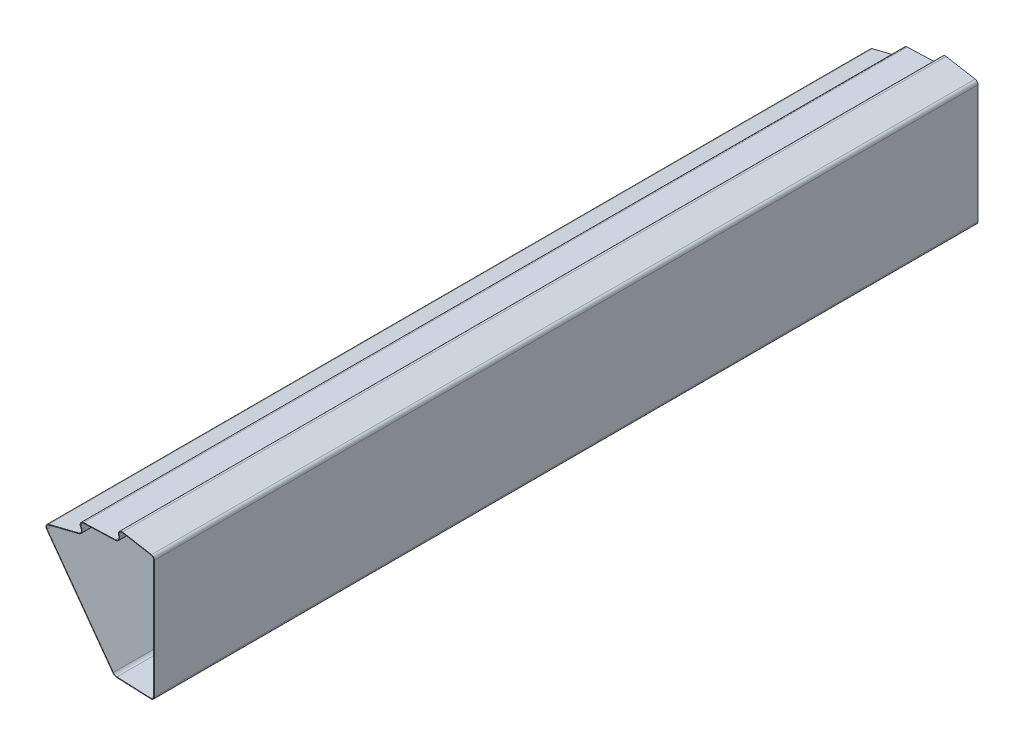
ISO-10303-21;
HEADER;
FILE_DESCRIPTION(('STEP AP214'),'2;1');
FILE_NAME('part.step','',(''),(''),'','','');
FILE_SCHEMA(('AUTOMOTIVE_DESIGN { 1 0 10303 214 1 1 1 1 }'));
ENDSEC;
DATA;
#1=APPLICATION_CONTEXT('core data for automotive mechanical design processes');
#2=APPLICATION_PROTOCOL_DEFINITION('international standard','automotive_design',2000,#1);
#3=PRODUCT_CONTEXT('',#1,'mechanical');
#4=PRODUCT('Part','Part','',(#3));
#5=PRODUCT_RELATED_PRODUCT_CATEGORY('part','',(#4));
#6=PRODUCT_DEFINITION_FORMATION('','',#4);
#7=PRODUCT_DEFINITION_CONTEXT('part definition',#1,'design');
#8=PRODUCT_DEFINITION('design','',#6,#7);
#9=PRODUCT_DEFINITION_SHAPE('','',#8);
#10=(LENGTH_UNIT() NAMED_UNIT(*) SI_UNIT(.MILLI.,.METRE.));
#11=(NAMED_UNIT(*) PLANE_ANGLE_UNIT() SI_UNIT($,.RADIAN.));
#12=(NAMED_UNIT(*) SI_UNIT($,.STERADIAN.) SOLID_ANGLE_UNIT());
#13=UNCERTAINTY_MEASURE_WITH_UNIT(LENGTH_MEASURE(1.E-05),#10,'distance_accuracy_value','');
#14=(GEOMETRIC_REPRESENTATION_CONTEXT(3) GLOBAL_UNCERTAINTY_ASSIGNED_CONTEXT((#13)) GLOBAL_UNIT_ASSIGNED_CONTEXT((#10,
#11,#12)) REPRESENTATION_CONTEXT('',''));
#15=CARTESIAN_POINT('',(0.,0.,0.));
#16=DIRECTION('',(0.,0.,1.));
#17=DIRECTION('',(1.,0.,0.));
#18=AXIS2_PLACEMENT_3D('',#15,#16,#17);
#19=CARTESIAN_POINT('',(-16.8583921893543,28.8514421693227,-213.5));
#20=DIRECTION('',(0.,0.,1.));
#21=DIRECTION('',(1.,0.,0.));
#22=AXIS2_PLACEMENT_3D('',#19,#20,#21);
#23=CYLINDRICAL_SURFACE('',#22,2.31972643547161);
#24=DIRECTION('',(0.,0.,1.));
#25=VECTOR('',#24,1.);
#26=CARTESIAN_POINT('',(-16.9638016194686,26.5341118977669,-213.5));
#27=LINE('',#26,#25);
#28=CARTESIAN_POINT('',(-16.9638016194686,26.5341118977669,-213.5));
#29=VERTEX_POINT('',#28);
#30=CARTESIAN_POINT('',(-16.9638016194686,26.5341118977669,137.50025));
#31=VERTEX_POINT('',#30);
#32=EDGE_CURVE('E228',#29,#31,#27,.T.);
#33=ORIENTED_EDGE('',*,*,#32,.T.);
#34=CARTESIAN_POINT('',(-16.8583921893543,28.8514421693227,137.50025));
#35=DIRECTION('',(0.,0.,1.));
#36=DIRECTION('',(-1.,0.,0.));
#37=AXIS2_PLACEMENT_3D('',#34,#35,#36);
#38=CIRCLE('',#37,2.31972643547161);
#39=CARTESIAN_POINT('',(-18.7350902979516,27.4879411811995,137.50025));
#40=VERTEX_POINT('',#39);
#41=EDGE_CURVE('E501',#40,#31,#38,.T.);
#42=ORIENTED_EDGE('',*,*,#41,.F.);
#43=DIRECTION('',(0.,0.,1.));
#44=VECTOR('',#43,1.);
#45=CARTESIAN_POINT('',(-18.7350902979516,27.4879411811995,-213.5));
#46=LINE('',#45,#44);
#47=CARTESIAN_POINT('',(-18.7350902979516,27.4879411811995,-213.5));
#48=VERTEX_POINT('',#47);
#49=EDGE_CURVE('E12',#48,#40,#46,.T.);
#50=ORIENTED_EDGE('',*,*,#49,.F.);
#51=CARTESIAN_POINT('',(-16.8583921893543,28.8514421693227,-213.5));
#52=DIRECTION('',(0.,0.,1.));
#53=DIRECTION('',(-1.,0.,0.));
#54=AXIS2_PLACEMENT_3D('',#51,#52,#53);
#55=CIRCLE('',#54,2.31972643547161);
#56=EDGE_CURVE('E592',#48,#29,#55,.T.);
#57=ORIENTED_EDGE('',*,*,#56,.T.);
#58=EDGE_LOOP('',(#33,#42,#50,#57));
#59=FACE_BOUND('',#58,.T.);
#60=ADVANCED_FACE('F225',(#59),#23,.T.);
#61=CARTESIAN_POINT('',(-46.8996745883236,66.2531657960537,-213.5));
#62=DIRECTION('',(-0.809016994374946,-0.587785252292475,0.));
#63=DIRECTION('',(0.587785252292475,-0.809016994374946,0.));
#64=AXIS2_PLACEMENT_3D('',#61,#62,#63);
#65=PLANE('',#64);
#66=ORIENTED_EDGE('',*,*,#49,.T.);
#67=DIRECTION('',(0.587785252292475,-0.809016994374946,0.));
#68=VECTOR('',#67,1.);
#69=CARTESIAN_POINT('',(-46.8996745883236,66.2531657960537,137.50025));
#70=LINE('',#69,#68);
#71=CARTESIAN_POINT('',(-46.8996745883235,66.2531657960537,137.50025));
#72=VERTEX_POINT('',#71);
#73=EDGE_CURVE('E546',#72,#40,#70,.T.);
#74=ORIENTED_EDGE('',*,*,#73,.F.);
#75=DIRECTION('',(0.,0.,1.));
#76=VECTOR('',#75,1.);
#77=CARTESIAN_POINT('',(-46.8996745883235,66.2531657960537,-213.5));
#78=LINE('',#77,#76);
#79=CARTESIAN_POINT('',(-46.8996745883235,66.2531657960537,-213.5));
#80=VERTEX_POINT('',#79);
#81=EDGE_CURVE('E233',#80,#72,#78,.T.);
#82=ORIENTED_EDGE('',*,*,#81,.F.);
#83=DIRECTION('',(0.587785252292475,-0.809016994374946,0.));
#84=VECTOR('',#83,1.);
#85=CARTESIAN_POINT('',(-46.8996745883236,66.2531657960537,-213.5));
#86=LINE('',#85,#84);
#87=EDGE_CURVE('E663',#80,#48,#86,.T.);
#88=ORIENTED_EDGE('',*,*,#87,.T.);
#89=EDGE_LOOP('',(#66,#74,#82,#88));
#90=FACE_BOUND('',#89,.T.);
#91=ADVANCED_FACE('F700',(#90),#65,.T.);
#92=CARTESIAN_POINT('',(-45.6861490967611,67.1348436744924,-213.5));
#93=DIRECTION('',(0.,0.,1.));
#94=DIRECTION('',(1.,0.,0.));
#95=AXIS2_PLACEMENT_3D('',#92,#93,#94);
#96=CYLINDRICAL_SURFACE('',#95,1.49999999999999);
#97=ORIENTED_EDGE('',*,*,#81,.T.);
#98=CARTESIAN_POINT('',(-45.6861490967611,67.1348436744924,137.50025));
#99=DIRECTION('',(0.,0.,1.));
#100=DIRECTION('',(1.,0.,0.));
#101=AXIS2_PLACEMENT_3D('',#98,#99,#100);
#102=CIRCLE('',#101,1.49999999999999);
#103=CARTESIAN_POINT('',(-46.0480943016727,68.5905207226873,137.50025));
#104=VERTEX_POINT('',#103);
#105=EDGE_CURVE('E543',#104,#72,#102,.T.);
#106=ORIENTED_EDGE('',*,*,#105,.F.);
#107=DIRECTION('',(0.,0.,1.));
#108=VECTOR('',#107,1.);
#109=CARTESIAN_POINT('',(-46.0480943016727,68.5905207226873,-213.5));
#110=LINE('',#109,#108);
#111=CARTESIAN_POINT('',(-46.0480943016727,68.5905207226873,-213.5));
#112=VERTEX_POINT('',#111);
#113=EDGE_CURVE('E667',#112,#104,#110,.T.);
#114=ORIENTED_EDGE('',*,*,#113,.F.);
#115=CARTESIAN_POINT('',(-45.6861490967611,67.1348436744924,-213.5));
#116=DIRECTION('',(0.,0.,1.));
#117=DIRECTION('',(1.,0.,0.));
#118=AXIS2_PLACEMENT_3D('',#115,#116,#117);
#119=CIRCLE('',#118,1.49999999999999);
#120=EDGE_CURVE('E660',#112,#80,#119,.T.);
#121=ORIENTED_EDGE('',*,*,#120,.T.);
#122=EDGE_LOOP('',(#97,#106,#114,#121));
#123=FACE_BOUND('',#122,.T.);
#124=ADVANCED_FACE('F753',(#123),#96,.T.);
#125=CARTESIAN_POINT('',(-46.0480943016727,68.5905207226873,-213.5));
#126=DIRECTION('',(-0.241296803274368,0.970451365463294,0.));
#127=DIRECTION('',(-0.970451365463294,-0.241296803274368,0.));
#128=AXIS2_PLACEMENT_3D('',#125,#126,#127);
#129=PLANE('',#128);
#130=ORIENTED_EDGE('',*,*,#113,.T.);
#131=DIRECTION('',(-0.970451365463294,-0.241296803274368,0.));
#132=VECTOR('',#131,1.);
#133=CARTESIAN_POINT('',(-46.0480943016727,68.5905207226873,137.50025));
#134=LINE('',#133,#132);
#135=CARTESIAN_POINT('',(-33.2023714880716,71.7845312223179,137.50025));
#136=VERTEX_POINT('',#135);
#137=EDGE_CURVE('E540',#136,#104,#134,.T.);
#138=ORIENTED_EDGE('',*,*,#137,.F.);
#139=DIRECTION('',(0.,0.,1.));
#140=VECTOR('',#139,1.);
#141=CARTESIAN_POINT('',(-33.2023714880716,71.7845312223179,-213.5));
#142=LINE('',#141,#140);
#143=CARTESIAN_POINT('',(-33.2023714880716,71.7845312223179,-213.5));
#144=VERTEX_POINT('',#143);
#145=EDGE_CURVE('E669',#144,#136,#142,.T.);
#146=ORIENTED_EDGE('',*,*,#145,.F.);
#147=DIRECTION('',(-0.970451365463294,-0.241296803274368,0.));
#148=VECTOR('',#147,1.);
#149=CARTESIAN_POINT('',(-46.0480943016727,68.5905207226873,-213.5));
#150=LINE('',#149,#148);
#151=EDGE_CURVE('E657',#144,#112,#150,.T.);
#152=ORIENTED_EDGE('',*,*,#151,.T.);
#153=EDGE_LOOP('',(#130,#138,#146,#152));
#154=FACE_BOUND('',#153,.T.);
#155=ADVANCED_FACE('F751',(#154),#129,.T.);
#156=CARTESIAN_POINT('',(-33.5643166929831,73.2402082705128,-213.5));
#157=DIRECTION('',(0.,0.,1.));
#158=DIRECTION('',(1.,0.,0.));
#159=AXIS2_PLACEMENT_3D('',#156,#157,#158);
#160=CYLINDRICAL_SURFACE('',#159,1.5);
#161=ORIENTED_EDGE('',*,*,#145,.T.);
#162=CARTESIAN_POINT('',(-33.5643166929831,73.2402082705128,137.50025));
#163=DIRECTION('',(0.,0.,-1.));
#164=DIRECTION('',(1.,0.,0.));
#165=AXIS2_PLACEMENT_3D('',#162,#163,#164);
#166=CIRCLE('',#165,1.5);
#167=CARTESIAN_POINT('',(-32.1892917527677,73.8396300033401,137.50025));
#168=VERTEX_POINT('',#167);
#169=EDGE_CURVE('E537',#168,#136,#166,.T.);
#170=ORIENTED_EDGE('',*,*,#169,.F.);
#171=DIRECTION('',(0.,0.,1.));
#172=VECTOR('',#171,1.);
#173=CARTESIAN_POINT('',(-32.1892917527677,73.8396300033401,-213.5));
#174=LINE('',#173,#172);
#175=CARTESIAN_POINT('',(-32.1892917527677,73.8396300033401,-213.5));
#176=VERTEX_POINT('',#175);
#177=EDGE_CURVE('E671',#176,#168,#174,.T.);
#178=ORIENTED_EDGE('',*,*,#177,.F.);
#179=CARTESIAN_POINT('',(-33.5643166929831,73.2402082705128,-213.5));
#180=DIRECTION('',(0.,0.,-1.));
#181=DIRECTION('',(1.,0.,0.));
#182=AXIS2_PLACEMENT_3D('',#179,#180,#181);
#183=CIRCLE('',#182,1.5);
#184=EDGE_CURVE('E654',#176,#144,#183,.T.);
#185=ORIENTED_EDGE('',*,*,#184,.T.);
#186=EDGE_LOOP('',(#161,#170,#178,#185));
#187=FACE_BOUND('',#186,.T.);
#188=ADVANCED_FACE('F749',(#187),#160,.F.);
#189=CARTESIAN_POINT('',(-32.5004855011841,74.5534832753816,-213.5));
#190=DIRECTION('',(-0.916683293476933,-0.399614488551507,0.));
#191=DIRECTION('',(0.399614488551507,-0.916683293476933,0.));
#192=AXIS2_PLACEMENT_3D('',#189,#190,#191);
#193=PLANE('',#192);
#194=ORIENTED_EDGE('',*,*,#177,.T.);
#195=DIRECTION('',(0.399614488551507,-0.916683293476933,0.));
#196=VECTOR('',#195,1.);
#197=CARTESIAN_POINT('',(-32.5004855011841,74.5534832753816,137.50025));
#198=LINE('',#197,#196);
#199=CARTESIAN_POINT('',(-32.5004855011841,74.5534832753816,137.50025));
#200=VERTEX_POINT('',#199);
#201=EDGE_CURVE('E534',#200,#168,#198,.T.);
#202=ORIENTED_EDGE('',*,*,#201,.F.);
#203=DIRECTION('',(0.,0.,1.));
#204=VECTOR('',#203,1.);
#205=CARTESIAN_POINT('',(-32.5004855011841,74.5534832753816,-213.5));
#206=LINE('',#205,#204);
#207=CARTESIAN_POINT('',(-32.5004855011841,74.5534832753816,-213.5));
#208=VERTEX_POINT('',#207);
#209=EDGE_CURVE('E673',#208,#200,#206,.T.);
#210=ORIENTED_EDGE('',*,*,#209,.F.);
#211=DIRECTION('',(0.399614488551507,-0.916683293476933,0.));
#212=VECTOR('',#211,1.);
#213=CARTESIAN_POINT('',(-32.5004855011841,74.5534832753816,-213.5));
#214=LINE('',#213,#212);
#215=EDGE_CURVE('E651',#208,#176,#214,.T.);
#216=ORIENTED_EDGE('',*,*,#215,.T.);
#217=EDGE_LOOP('',(#194,#202,#210,#216));
#218=FACE_BOUND('',#217,.T.);
#219=ADVANCED_FACE('F744',(#218),#193,.T.);
#220=CARTESIAN_POINT('',(-31.1254605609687,75.1529050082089,-213.5));
#221=DIRECTION('',(0.,0.,1.));
#222=DIRECTION('',(1.,0.,0.));
#223=AXIS2_PLACEMENT_3D('',#220,#221,#222);
#224=CYLINDRICAL_SURFACE('',#223,1.50000000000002);
#225=ORIENTED_EDGE('',*,*,#209,.T.);
#226=CARTESIAN_POINT('',(-31.1254605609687,75.1529050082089,137.50025));
#227=DIRECTION('',(0.,0.,1.));
#228=DIRECTION('',(1.,0.,0.));
#229=AXIS2_PLACEMENT_3D('',#226,#227,#228);
#230=CIRCLE('',#229,1.50000000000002);
#231=CARTESIAN_POINT('',(-31.1768441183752,76.6520246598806,137.50025));
#232=VERTEX_POINT('',#231);
#233=EDGE_CURVE('E531',#232,#200,#230,.T.);
#234=ORIENTED_EDGE('',*,*,#233,.F.);
#235=DIRECTION('',(0.,0.,1.));
#236=VECTOR('',#235,1.);
#237=CARTESIAN_POINT('',(-31.1768441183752,76.6520246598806,-213.5));
#238=LINE('',#237,#236);
#239=CARTESIAN_POINT('',(-31.1768441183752,76.6520246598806,-213.5));
#240=VERTEX_POINT('',#239);
#241=EDGE_CURVE('E675',#240,#232,#238,.T.);
#242=ORIENTED_EDGE('',*,*,#241,.F.);
#243=CARTESIAN_POINT('',(-31.1254605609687,75.1529050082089,-213.5));
#244=DIRECTION('',(0.,0.,1.));
#245=DIRECTION('',(1.,0.,0.));
#246=AXIS2_PLACEMENT_3D('',#243,#244,#245);
#247=CIRCLE('',#246,1.50000000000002);
#248=EDGE_CURVE('E648',#240,#208,#247,.T.);
#249=ORIENTED_EDGE('',*,*,#248,.T.);
#250=EDGE_LOOP('',(#225,#234,#242,#249));
#251=FACE_BOUND('',#250,.T.);
#252=ADVANCED_FACE('F740',(#251),#224,.T.);
#253=CARTESIAN_POINT('',(-31.1768441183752,76.6520246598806,-213.5));
#254=DIRECTION('',(-0.0342557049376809,0.99941310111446,0.));
#255=DIRECTION('',(-0.99941310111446,-0.0342557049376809,0.));
#256=AXIS2_PLACEMENT_3D('',#253,#254,#255);
#257=PLANE('',#256);
#258=ORIENTED_EDGE('',*,*,#241,.T.);
#259=DIRECTION('',(-0.99941310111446,-0.0342557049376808,0.));
#260=VECTOR('',#259,1.);
#261=CARTESIAN_POINT('',(-31.1768441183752,76.6520246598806,137.50025));
#262=LINE('',#261,#260);
#263=CARTESIAN_POINT('',(-17.5519767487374,77.1190281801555,137.50025));
#264=VERTEX_POINT('',#263);
#265=EDGE_CURVE('E528',#264,#232,#262,.T.);
#266=ORIENTED_EDGE('',*,*,#265,.F.);
#267=DIRECTION('',(0.,0.,1.));
#268=VECTOR('',#267,1.);
#269=CARTESIAN_POINT('',(-17.5519767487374,77.1190281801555,-213.5));
#270=LINE('',#269,#268);
#271=CARTESIAN_POINT('',(-17.5519767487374,77.1190281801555,-213.5));
#272=VERTEX_POINT('',#271);
#273=EDGE_CURVE('E677',#272,#264,#270,.T.);
#274=ORIENTED_EDGE('',*,*,#273,.F.);
#275=DIRECTION('',(-0.99941310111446,-0.0342557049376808,0.));
#276=VECTOR('',#275,1.);
#277=CARTESIAN_POINT('',(-31.1768441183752,76.6520246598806,-213.5));
#278=LINE('',#277,#276);
#279=EDGE_CURVE('E645',#272,#240,#278,.T.);
#280=ORIENTED_EDGE('',*,*,#279,.T.);
#281=EDGE_LOOP('',(#258,#266,#274,#280));
#282=FACE_BOUND('',#281,.T.);
#283=ADVANCED_FACE('F738',(#282),#257,.T.);
#284=CARTESIAN_POINT('',(-17.6033603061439,78.6181478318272,-213.5));
#285=DIRECTION('',(0.,0.,1.));
#286=DIRECTION('',(1.,0.,0.));
#287=AXIS2_PLACEMENT_3D('',#284,#285,#286);
#288=CYLINDRICAL_SURFACE('',#287,1.50000000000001);
#289=ORIENTED_EDGE('',*,*,#273,.T.);
#290=CARTESIAN_POINT('',(-17.6033603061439,78.6181478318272,137.50025));
#291=DIRECTION('',(0.,0.,-1.));
#292=DIRECTION('',(1.,0.,0.));
#293=AXIS2_PLACEMENT_3D('',#290,#291,#292);
#294=CIRCLE('',#293,1.50000000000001);
#295=CARTESIAN_POINT('',(-16.133756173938,78.9185870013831,137.50025));
#296=VERTEX_POINT('',#295);
#297=EDGE_CURVE('E525',#296,#264,#294,.T.);
#298=ORIENTED_EDGE('',*,*,#297,.F.);
#299=DIRECTION('',(0.,0.,1.));
#300=VECTOR('',#299,1.);
#301=CARTESIAN_POINT('',(-16.133756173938,78.9185870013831,-213.5));
#302=LINE('',#301,#300);
#303=CARTESIAN_POINT('',(-16.133756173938,78.9185870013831,-213.5));
#304=VERTEX_POINT('',#303);
#305=EDGE_CURVE('E679',#304,#296,#302,.T.);
#306=ORIENTED_EDGE('',*,*,#305,.F.);
#307=CARTESIAN_POINT('',(-17.6033603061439,78.6181478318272,-213.5));
#308=DIRECTION('',(0.,0.,-1.));
#309=DIRECTION('',(1.,0.,0.));
#310=AXIS2_PLACEMENT_3D('',#307,#308,#309);
#311=CIRCLE('',#310,1.50000000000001);
#312=EDGE_CURVE('E642',#304,#272,#311,.T.);
#313=ORIENTED_EDGE('',*,*,#312,.T.);
#314=EDGE_LOOP('',(#289,#298,#306,#313));
#315=FACE_BOUND('',#314,.T.);
#316=ADVANCED_FACE('F733',(#315),#288,.F.);
#317=CARTESIAN_POINT('',(-16.2897311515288,79.6815416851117,-213.5));
#318=DIRECTION('',(-0.979736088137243,-0.200292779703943,0.));
#319=DIRECTION('',(0.200292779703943,-0.979736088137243,0.));
#320=AXIS2_PLACEMENT_3D('',#317,#318,#319);
#321=PLANE('',#320);
#322=ORIENTED_EDGE('',*,*,#305,.T.);
#323=DIRECTION('',(0.200292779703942,-0.979736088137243,0.));
#324=VECTOR('',#323,1.);
#325=CARTESIAN_POINT('',(-16.2897311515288,79.6815416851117,137.50025));
#326=LINE('',#325,#324);
#327=CARTESIAN_POINT('',(-16.2897311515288,79.6815416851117,137.50025));
#328=VERTEX_POINT('',#327);
#329=EDGE_CURVE('E522',#328,#296,#326,.T.);
#330=ORIENTED_EDGE('',*,*,#329,.F.);
#331=DIRECTION('',(0.,0.,1.));
#332=VECTOR('',#331,1.);
#333=CARTESIAN_POINT('',(-16.2897311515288,79.6815416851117,-213.5));
#334=LINE('',#333,#332);
#335=CARTESIAN_POINT('',(-16.2897311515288,79.6815416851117,-213.5));
#336=VERTEX_POINT('',#335);
#337=EDGE_CURVE('E681',#336,#328,#334,.T.);
#338=ORIENTED_EDGE('',*,*,#337,.F.);
#339=DIRECTION('',(0.200292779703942,-0.979736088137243,0.));
#340=VECTOR('',#339,1.);
#341=CARTESIAN_POINT('',(-16.2897311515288,79.6815416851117,-213.5));
#342=LINE('',#341,#340);
#343=EDGE_CURVE('E639',#336,#304,#342,.T.);
#344=ORIENTED_EDGE('',*,*,#343,.T.);
#345=EDGE_LOOP('',(#322,#330,#338,#344));
#346=FACE_BOUND('',#345,.T.);
#347=ADVANCED_FACE('F728',(#346),#321,.T.);
#348=CARTESIAN_POINT('',(-14.820127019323,79.9819808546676,-213.5));
#349=DIRECTION('',(0.,0.,1.));
#350=DIRECTION('',(1.,0.,0.));
#351=AXIS2_PLACEMENT_3D('',#348,#349,#350);
#352=CYLINDRICAL_SURFACE('',#351,1.49999999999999);
#353=ORIENTED_EDGE('',*,*,#337,.T.);
#354=CARTESIAN_POINT('',(-14.820127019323,79.9819808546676,137.50025));
#355=DIRECTION('',(0.,0.,1.));
#356=DIRECTION('',(1.,0.,0.));
#357=AXIS2_PLACEMENT_3D('',#354,#355,#356);
#358=CIRCLE('',#357,1.49999999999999);
#359=CARTESIAN_POINT('',(-14.5587032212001,81.4590243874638,137.50025));
#360=VERTEX_POINT('',#359);
#361=EDGE_CURVE('E519',#360,#328,#358,.T.);
#362=ORIENTED_EDGE('',*,*,#361,.F.);
#363=DIRECTION('',(0.,0.,1.));
#364=VECTOR('',#363,1.);
#365=CARTESIAN_POINT('',(-14.5587032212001,81.4590243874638,-213.5));
#366=LINE('',#365,#364);
#367=CARTESIAN_POINT('',(-14.5587032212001,81.4590243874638,-213.5));
#368=VERTEX_POINT('',#367);
#369=EDGE_CURVE('E683',#368,#360,#366,.T.);
#370=ORIENTED_EDGE('',*,*,#369,.F.);
#371=CARTESIAN_POINT('',(-14.820127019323,79.9819808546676,-213.5));
#372=DIRECTION('',(0.,0.,1.));
#373=DIRECTION('',(1.,0.,0.));
#374=AXIS2_PLACEMENT_3D('',#371,#372,#373);
#375=CIRCLE('',#374,1.49999999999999);
#376=EDGE_CURVE('E636',#368,#336,#375,.T.);
#377=ORIENTED_EDGE('',*,*,#376,.T.);
#378=EDGE_LOOP('',(#353,#362,#370,#377));
#379=FACE_BOUND('',#378,.T.);
#380=ADVANCED_FACE('F726',(#379),#352,.T.);
#381=CARTESIAN_POINT('',(-14.5587032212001,81.4590243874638,-213.5));
#382=DIRECTION('',(0.174282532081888,0.98469568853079,0.));
#383=DIRECTION('',(-0.98469568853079,0.174282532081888,0.));
#384=AXIS2_PLACEMENT_3D('',#381,#382,#383);
#385=PLANE('',#384);
#386=ORIENTED_EDGE('',*,*,#369,.T.);
#387=DIRECTION('',(-0.984695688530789,0.174282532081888,0.));
#388=VECTOR('',#387,1.);
#389=CARTESIAN_POINT('',(-14.5587032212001,81.4590243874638,137.50025));
#390=LINE('',#389,#388);
#391=CARTESIAN_POINT('',(-2.23857620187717,79.2784695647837,137.50025));
#392=VERTEX_POINT('',#391);
#393=EDGE_CURVE('E516',#392,#360,#390,.T.);
#394=ORIENTED_EDGE('',*,*,#393,.F.);
#395=DIRECTION('',(0.,0.,1.));
#396=VECTOR('',#395,1.);
#397=CARTESIAN_POINT('',(-2.23857620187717,79.2784695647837,-213.5));
#398=LINE('',#397,#396);
#399=CARTESIAN_POINT('',(-2.23857620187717,79.2784695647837,-213.5));
#400=VERTEX_POINT('',#399);
#401=EDGE_CURVE('E685',#400,#392,#398,.T.);
#402=ORIENTED_EDGE('',*,*,#401,.F.);
#403=DIRECTION('',(-0.984695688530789,0.174282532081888,0.));
#404=VECTOR('',#403,1.);
#405=CARTESIAN_POINT('',(-14.5587032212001,81.4590243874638,-213.5));
#406=LINE('',#405,#404);
#407=EDGE_CURVE('E633',#400,#368,#406,.T.);
#408=ORIENTED_EDGE('',*,*,#407,.T.);
#409=EDGE_LOOP('',(#386,#394,#402,#408));
#410=FACE_BOUND('',#409,.T.);
#411=ADVANCED_FACE('F721',(#410),#385,.T.);
#412=CARTESIAN_POINT('',(-2.5,77.8014260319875,-213.5));
#413=DIRECTION('',(0.,0.,1.));
#414=DIRECTION('',(1.,0.,0.));
#415=AXIS2_PLACEMENT_3D('',#412,#413,#414);
#416=CYLINDRICAL_SURFACE('',#415,1.5);
#417=ORIENTED_EDGE('',*,*,#401,.T.);
#418=CARTESIAN_POINT('',(-2.5,77.8014260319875,137.50025));
#419=DIRECTION('',(0.,0.,1.));
#420=DIRECTION('',(-1.,0.,0.));
#421=AXIS2_PLACEMENT_3D('',#418,#419,#420);
#422=CIRCLE('',#421,1.5);
#423=CARTESIAN_POINT('',(-1.,77.8014260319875,137.50025));
#424=VERTEX_POINT('',#423);
#425=EDGE_CURVE('E513',#424,#392,#422,.T.);
#426=ORIENTED_EDGE('',*,*,#425,.F.);
#427=DIRECTION('',(0.,0.,1.));
#428=VECTOR('',#427,1.);
#429=CARTESIAN_POINT('',(-1.,77.8014260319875,-213.5));
#430=LINE('',#429,#428);
#431=CARTESIAN_POINT('',(-1.,77.8014260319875,-213.5));
#432=VERTEX_POINT('',#431);
#433=EDGE_CURVE('E687',#432,#424,#430,.T.);
#434=ORIENTED_EDGE('',*,*,#433,.F.);
#435=CARTESIAN_POINT('',(-2.5,77.8014260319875,-213.5));
#436=DIRECTION('',(0.,0.,1.));
#437=DIRECTION('',(-1.,0.,0.));
#438=AXIS2_PLACEMENT_3D('',#435,#436,#437);
#439=CIRCLE('',#438,1.5);
#440=EDGE_CURVE('E630',#432,#400,#439,.T.);
#441=ORIENTED_EDGE('',*,*,#440,.T.);
#442=EDGE_LOOP('',(#417,#426,#434,#441));
#443=FACE_BOUND('',#442,.T.);
#444=ADVANCED_FACE('F716',(#443),#416,.T.);
#445=CARTESIAN_POINT('',(-1.,77.8014260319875,-213.5));
#446=DIRECTION('',(1.,0.,0.));
#447=DIRECTION('',(0.,1.,0.));
#448=AXIS2_PLACEMENT_3D('',#445,#446,#447);
#449=PLANE('',#448);
#450=ORIENTED_EDGE('',*,*,#433,.T.);
#451=DIRECTION('',(0.,1.,0.));
#452=VECTOR('',#451,1.);
#453=CARTESIAN_POINT('',(-1.,77.8014260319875,137.50025));
#454=LINE('',#453,#452);
#455=CARTESIAN_POINT('',(-1.,27.377741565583,137.50025));
#456=VERTEX_POINT('',#455);
#457=EDGE_CURVE('E510',#456,#424,#454,.T.);
#458=ORIENTED_EDGE('',*,*,#457,.F.);
#459=DIRECTION('',(0.,0.,1.));
#460=VECTOR('',#459,1.);
#461=CARTESIAN_POINT('',(-1.,27.377741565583,-213.5));
#462=LINE('',#461,#460);
#463=CARTESIAN_POINT('',(-1.,27.377741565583,-213.5));
#464=VERTEX_POINT('',#463);
#465=EDGE_CURVE('E689',#464,#456,#462,.T.);
#466=ORIENTED_EDGE('',*,*,#465,.F.);
#467=DIRECTION('',(0.,1.,0.));
#468=VECTOR('',#467,1.);
#469=CARTESIAN_POINT('',(-1.,77.8014260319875,-213.5));
#470=LINE('',#469,#468);
#471=EDGE_CURVE('E627',#464,#432,#470,.T.);
#472=ORIENTED_EDGE('',*,*,#471,.T.);
#473=EDGE_LOOP('',(#450,#458,#466,#472));
#474=FACE_BOUND('',#473,.T.);
#475=ADVANCED_FACE('F714',(#474),#449,.T.);
#476=CARTESIAN_POINT('',(-2.5,27.377741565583,-213.5));
#477=DIRECTION('',(0.,0.,1.));
#478=DIRECTION('',(1.,0.,0.));
#479=AXIS2_PLACEMENT_3D('',#476,#477,#478);
#480=CYLINDRICAL_SURFACE('',#479,1.5);
#481=ORIENTED_EDGE('',*,*,#465,.T.);
#482=CARTESIAN_POINT('',(-2.5,27.377741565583,137.50025));
#483=DIRECTION('',(0.,0.,1.));
#484=DIRECTION('',(-1.,0.,0.));
#485=AXIS2_PLACEMENT_3D('',#482,#483,#484);
#486=CIRCLE('',#485,1.5);
#487=CARTESIAN_POINT('',(-2.56816068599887,25.8792909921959,137.50025));
#488=VERTEX_POINT('',#487);
#489=EDGE_CURVE('E507',#488,#456,#486,.T.);
#490=ORIENTED_EDGE('',*,*,#489,.F.);
#491=DIRECTION('',(0.,0.,1.));
#492=VECTOR('',#491,1.);
#493=CARTESIAN_POINT('',(-2.56816068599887,25.8792909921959,-213.5));
#494=LINE('',#493,#492);
#495=CARTESIAN_POINT('',(-2.56816068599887,25.8792909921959,-213.5));
#496=VERTEX_POINT('',#495);
#497=EDGE_CURVE('E690',#496,#488,#494,.T.);
#498=ORIENTED_EDGE('',*,*,#497,.F.);
#499=CARTESIAN_POINT('',(-2.5,27.377741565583,-213.5));
#500=DIRECTION('',(0.,0.,1.));
#501=DIRECTION('',(-1.,0.,0.));
#502=AXIS2_PLACEMENT_3D('',#499,#500,#501);
#503=CIRCLE('',#502,1.5);
#504=EDGE_CURVE('E624',#496,#464,#503,.T.);
#505=ORIENTED_EDGE('',*,*,#504,.T.);
#506=EDGE_LOOP('',(#481,#490,#498,#505));
#507=FACE_BOUND('',#506,.T.);
#508=ADVANCED_FACE('F710',(#507),#480,.T.);
#509=CARTESIAN_POINT('',(-16.9638016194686,26.5341118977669,-213.5));
#510=DIRECTION('',(-0.0454404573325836,-0.998967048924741,0.));
#511=DIRECTION('',(0.998967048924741,-0.0454404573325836,0.));
#512=AXIS2_PLACEMENT_3D('',#509,#510,#511);
#513=PLANE('',#512);
#514=ORIENTED_EDGE('',*,*,#497,.T.);
#515=DIRECTION('',(0.998967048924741,-0.0454404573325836,0.));
#516=VECTOR('',#515,1.);
#517=CARTESIAN_POINT('',(-16.9638016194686,26.5341118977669,137.50025));
#518=LINE('',#517,#516);
#519=EDGE_CURVE('E504',#31,#488,#518,.T.);
#520=ORIENTED_EDGE('',*,*,#519,.F.);
#521=ORIENTED_EDGE('',*,*,#32,.F.);
#522=DIRECTION('',(0.998967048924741,-0.0454404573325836,0.));
#523=VECTOR('',#522,1.);
#524=CARTESIAN_POINT('',(-16.9638016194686,26.5341118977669,-213.5));
#525=LINE('',#524,#523);
#526=EDGE_CURVE('E621',#29,#496,#525,.T.);
#527=ORIENTED_EDGE('',*,*,#526,.T.);
#528=EDGE_LOOP('',(#514,#520,#521,#527));
#529=FACE_BOUND('',#528,.T.);
#530=ADVANCED_FACE('F694',(#529),#513,.T.);
#531=CARTESIAN_POINT('',(-16.8583921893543,28.8514421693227,-213.5));
#532=DIRECTION('',(0.,0.,1.));
#533=DIRECTION('',(1.,0.,0.));
#534=AXIS2_PLACEMENT_3D('',#531,#532,#533);
#535=PLANE('',#534);
#536=DIRECTION('',(0.587785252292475,-0.809016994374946,0.));
#537=VECTOR('',#536,1.);
#538=CARTESIAN_POINT('',(-18.5166557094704,27.6466431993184,-213.5));
#539=LINE('',#538,#537);
#540=CARTESIAN_POINT('',(-46.6812399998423,66.4118678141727,-213.5));
#541=VERTEX_POINT('',#540);
#542=CARTESIAN_POINT('',(-18.5166557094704,27.6466431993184,-213.5));
#543=VERTEX_POINT('',#542);
#544=EDGE_CURVE('E446',#541,#543,#539,.T.);
#545=ORIENTED_EDGE('',*,*,#544,.T.);
#546=CARTESIAN_POINT('',(-16.8583921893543,28.8514421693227,-213.5));
#547=DIRECTION('',(0.,0.,-1.));
#548=DIRECTION('',(-1.,0.,0.));
#549=AXIS2_PLACEMENT_3D('',#546,#547,#548);
#550=CIRCLE('',#549,2.04972643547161);
#551=CARTESIAN_POINT('',(-16.9515326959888,26.8038330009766,-213.5));
#552=VERTEX_POINT('',#551);
#553=EDGE_CURVE('E549',#543,#552,#550,.F.);
#554=ORIENTED_EDGE('',*,*,#553,.T.);
#555=DIRECTION('',(0.998967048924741,-0.0454404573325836,0.));
#556=VECTOR('',#555,1.);
#557=CARTESIAN_POINT('',(-16.9515326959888,26.8038330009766,-213.5));
#558=LINE('',#557,#556);
#559=CARTESIAN_POINT('',(-2.55589176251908,26.1490120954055,-213.5));
#560=VERTEX_POINT('',#559);
#561=EDGE_CURVE('E441',#552,#560,#558,.T.);
#562=ORIENTED_EDGE('',*,*,#561,.T.);
#563=CARTESIAN_POINT('',(-2.5,27.377741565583,-213.5));
#564=DIRECTION('',(0.,0.,-1.));
#565=DIRECTION('',(-1.,0.,0.));
#566=AXIS2_PLACEMENT_3D('',#563,#564,#565);
#567=CIRCLE('',#566,1.23);
#568=CARTESIAN_POINT('',(-1.27,27.377741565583,-213.5));
#569=VERTEX_POINT('',#568);
#570=EDGE_CURVE('E241',#560,#569,#567,.F.);
#571=ORIENTED_EDGE('',*,*,#570,.T.);
#572=DIRECTION('',(0.,1.,0.));
#573=VECTOR('',#572,1.);
#574=CARTESIAN_POINT('',(-1.27,28.8514421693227,-213.5));
#575=LINE('',#574,#573);
#576=CARTESIAN_POINT('',(-1.27,77.8014260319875,-213.5));
#577=VERTEX_POINT('',#576);
#578=EDGE_CURVE('E553',#569,#577,#575,.T.);
#579=ORIENTED_EDGE('',*,*,#578,.T.);
#580=CARTESIAN_POINT('',(-2.5,77.8014260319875,-213.5));
#581=DIRECTION('',(0.,0.,-1.));
#582=DIRECTION('',(-1.,0.,0.));
#583=AXIS2_PLACEMENT_3D('',#580,#581,#582);
#584=CIRCLE('',#583,1.23);
#585=CARTESIAN_POINT('',(-2.28563248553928,79.0126017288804,-213.5));
#586=VERTEX_POINT('',#585);
#587=EDGE_CURVE('E556',#577,#586,#584,.F.);
#588=ORIENTED_EDGE('',*,*,#587,.T.);
#589=DIRECTION('',(-0.98469568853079,0.174282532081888,0.));
#590=VECTOR('',#589,1.);
#591=CARTESIAN_POINT('',(-7.80733300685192,79.9898944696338,-213.5));
#592=LINE('',#591,#590);
#593=CARTESIAN_POINT('',(-14.6057595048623,81.1931565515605,-213.5));
#594=VERTEX_POINT('',#593);
#595=EDGE_CURVE('E559',#586,#594,#592,.T.);
#596=ORIENTED_EDGE('',*,*,#595,.T.);
#597=CARTESIAN_POINT('',(-14.820127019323,79.9819808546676,-213.5));
#598=DIRECTION('',(0.,0.,-1.));
#599=DIRECTION('',(-1.,0.,0.));
#600=AXIS2_PLACEMENT_3D('',#597,#598,#599);
#601=CIRCLE('',#600,1.22999999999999);
#602=CARTESIAN_POINT('',(-16.0252024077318,79.7356207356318,-213.5));
#603=VERTEX_POINT('',#602);
#604=EDGE_CURVE('E562',#594,#603,#601,.F.);
#605=ORIENTED_EDGE('',*,*,#604,.T.);
#606=DIRECTION('',(0.200292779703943,-0.979736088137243,0.));
#607=VECTOR('',#606,1.);
#608=CARTESIAN_POINT('',(-6.07341846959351,31.056273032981,-213.5));
#609=LINE('',#608,#607);
#610=CARTESIAN_POINT('',(-15.869227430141,78.9726660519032,-213.5));
#611=VERTEX_POINT('',#610);
#612=EDGE_CURVE('E565',#603,#611,#609,.T.);
#613=ORIENTED_EDGE('',*,*,#612,.T.);
#614=CARTESIAN_POINT('',(-17.6033603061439,78.6181478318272,-213.5));
#615=DIRECTION('',(0.,0.,-1.));
#616=DIRECTION('',(-1.,0.,0.));
#617=AXIS2_PLACEMENT_3D('',#614,#615,#616);
#618=CIRCLE('',#617,1.77000000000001);
#619=CARTESIAN_POINT('',(-17.5427277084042,76.8491866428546,-213.5));
#620=VERTEX_POINT('',#619);
#621=EDGE_CURVE('E568',#611,#620,#618,.T.);
#622=ORIENTED_EDGE('',*,*,#621,.T.);
#623=DIRECTION('',(-0.99941310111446,-0.0342557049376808,0.));
#624=VECTOR('',#623,1.);
#625=CARTESIAN_POINT('',(-18.5024268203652,76.8162921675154,-213.5));
#626=LINE('',#625,#624);
#627=CARTESIAN_POINT('',(-31.167595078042,76.3821831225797,-213.5));
#628=VERTEX_POINT('',#627);
#629=EDGE_CURVE('E571',#620,#628,#626,.T.);
#630=ORIENTED_EDGE('',*,*,#629,.T.);
#631=CARTESIAN_POINT('',(-31.1254605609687,75.1529050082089,-213.5));
#632=DIRECTION('',(0.,0.,-1.));
#633=DIRECTION('',(-1.,0.,0.));
#634=AXIS2_PLACEMENT_3D('',#631,#632,#633);
#635=CIRCLE('',#634,1.23000000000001);
#636=CARTESIAN_POINT('',(-32.2529810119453,74.6613791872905,-213.5));
#637=VERTEX_POINT('',#636);
#638=EDGE_CURVE('E574',#628,#637,#635,.F.);
#639=ORIENTED_EDGE('',*,*,#638,.T.);
#640=DIRECTION('',(0.399614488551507,-0.916683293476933,0.));
#641=VECTOR('',#640,1.);
#642=CARTESIAN_POINT('',(-13.0134996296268,30.5275660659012,-213.5));
#643=LINE('',#642,#641);
#644=CARTESIAN_POINT('',(-31.941787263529,73.947525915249,-213.5));
#645=VERTEX_POINT('',#644);
#646=EDGE_CURVE('E577',#637,#645,#643,.T.);
#647=ORIENTED_EDGE('',*,*,#646,.T.);
#648=CARTESIAN_POINT('',(-33.5643166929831,73.2402082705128,-213.5));
#649=DIRECTION('',(0.,0.,-1.));
#650=DIRECTION('',(-1.,0.,0.));
#651=AXIS2_PLACEMENT_3D('',#648,#649,#650);
#652=CIRCLE('',#651,1.77);
#653=CARTESIAN_POINT('',(-33.1372213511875,71.5225093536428,-213.5));
#654=VERTEX_POINT('',#653);
#655=EDGE_CURVE('E580',#645,#654,#652,.T.);
#656=ORIENTED_EDGE('',*,*,#655,.T.);
#657=DIRECTION('',(-0.970451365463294,-0.241296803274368,0.));
#658=VECTOR('',#657,1.);
#659=CARTESIAN_POINT('',(-27.798360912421,72.8499843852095,-213.5));
#660=LINE('',#659,#658);
#661=CARTESIAN_POINT('',(-45.9829441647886,68.3284988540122,-213.5));
#662=VERTEX_POINT('',#661);
#663=EDGE_CURVE('E583',#654,#662,#660,.T.);
#664=ORIENTED_EDGE('',*,*,#663,.T.);
#665=CARTESIAN_POINT('',(-45.6861490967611,67.1348436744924,-213.5));
#666=DIRECTION('',(0.,0.,-1.));
#667=DIRECTION('',(-1.,0.,0.));
#668=AXIS2_PLACEMENT_3D('',#665,#666,#667);
#669=CIRCLE('',#668,1.22999999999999);
#670=EDGE_CURVE('E586',#662,#541,#669,.F.);
#671=ORIENTED_EDGE('',*,*,#670,.T.);
#672=EDGE_LOOP('',(#545,#554,#562,#571,#579,#588,#596,#605,#613,#622,#630,#639,#647,#656,#664,#671));
#673=FACE_BOUND('',#672,.T.);
#674=ORIENTED_EDGE('',*,*,#56,.F.);
#675=ORIENTED_EDGE('',*,*,#87,.F.);
#676=ORIENTED_EDGE('',*,*,#120,.F.);
#677=ORIENTED_EDGE('',*,*,#151,.F.);
#678=ORIENTED_EDGE('',*,*,#184,.F.);
#679=ORIENTED_EDGE('',*,*,#215,.F.);
#680=ORIENTED_EDGE('',*,*,#248,.F.);
#681=ORIENTED_EDGE('',*,*,#279,.F.);
#682=ORIENTED_EDGE('',*,*,#312,.F.);
#683=ORIENTED_EDGE('',*,*,#343,.F.);
#684=ORIENTED_EDGE('',*,*,#376,.F.);
#685=ORIENTED_EDGE('',*,*,#407,.F.);
#686=ORIENTED_EDGE('',*,*,#440,.F.);
#687=ORIENTED_EDGE('',*,*,#471,.F.);
#688=ORIENTED_EDGE('',*,*,#504,.F.);
#689=ORIENTED_EDGE('',*,*,#526,.F.);
#690=EDGE_LOOP('',(#674,#675,#676,#677,#678,#679,#680,#681,#682,#683,#684,#685,#686,#687,#688,#689));
#691=FACE_BOUND('',#690,.T.);
#692=ADVANCED_FACE('F704',(#673,#691),#535,.F.);
#693=CARTESIAN_POINT('',(-16.8583921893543,28.8514421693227,-213.5));
#694=DIRECTION('',(0.,0.,1.));
#695=DIRECTION('',(1.,0.,0.));
#696=AXIS2_PLACEMENT_3D('',#693,#694,#695);
#697=CYLINDRICAL_SURFACE('',#696,2.04972643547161);
#698=DIRECTION('',(0.,0.,1.));
#699=VECTOR('',#698,1.);
#700=CARTESIAN_POINT('',(-18.5166557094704,27.6466431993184,-213.5));
#701=LINE('',#700,#699);
#702=CARTESIAN_POINT('',(-18.5166557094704,27.6466431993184,137.50025));
#703=VERTEX_POINT('',#702);
#704=EDGE_CURVE('E451',#543,#703,#701,.T.);
#705=ORIENTED_EDGE('',*,*,#704,.T.);
#706=CARTESIAN_POINT('',(-16.8583921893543,28.8514421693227,137.50025));
#707=DIRECTION('',(0.,0.,-1.));
#708=DIRECTION('',(-1.,0.,0.));
#709=AXIS2_PLACEMENT_3D('',#706,#707,#708);
#710=CIRCLE('',#709,2.04972643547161);
#711=CARTESIAN_POINT('',(-16.9515326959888,26.8038330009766,137.50025));
#712=VERTEX_POINT('',#711);
#713=EDGE_CURVE('E449',#703,#712,#710,.F.);
#714=ORIENTED_EDGE('',*,*,#713,.T.);
#715=DIRECTION('',(0.,0.,1.));
#716=VECTOR('',#715,1.);
#717=CARTESIAN_POINT('',(-16.9515326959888,26.8038330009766,-213.5));
#718=LINE('',#717,#716);
#719=EDGE_CURVE('E434',#552,#712,#718,.T.);
#720=ORIENTED_EDGE('',*,*,#719,.F.);
#721=ORIENTED_EDGE('',*,*,#553,.F.);
#722=EDGE_LOOP('',(#705,#714,#720,#721));
#723=FACE_BOUND('',#722,.T.);
#724=ADVANCED_FACE('F450',(#723),#697,.F.);
#725=CARTESIAN_POINT('',(-18.5166557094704,27.6466431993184,-213.5));
#726=DIRECTION('',(-0.809016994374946,-0.587785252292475,0.));
#727=DIRECTION('',(0.587785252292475,-0.809016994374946,0.));
#728=AXIS2_PLACEMENT_3D('',#725,#726,#727);
#729=PLANE('',#728);
#730=DIRECTION('',(0.,0.,1.));
#731=VECTOR('',#730,1.);
#732=CARTESIAN_POINT('',(-46.6812399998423,66.4118678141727,-213.5));
#733=LINE('',#732,#731);
#734=CARTESIAN_POINT('',(-46.6812399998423,66.4118678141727,137.50025));
#735=VERTEX_POINT('',#734);
#736=EDGE_CURVE('E593',#541,#735,#733,.T.);
#737=ORIENTED_EDGE('',*,*,#736,.T.);
#738=DIRECTION('',(0.587785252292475,-0.809016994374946,0.));
#739=VECTOR('',#738,1.);
#740=CARTESIAN_POINT('',(-18.5166557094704,27.6466431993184,137.50025));
#741=LINE('',#740,#739);
#742=EDGE_CURVE('E499',#735,#703,#741,.T.);
#743=ORIENTED_EDGE('',*,*,#742,.T.);
#744=ORIENTED_EDGE('',*,*,#704,.F.);
#745=ORIENTED_EDGE('',*,*,#544,.F.);
#746=EDGE_LOOP('',(#737,#743,#744,#745));
#747=FACE_BOUND('',#746,.T.);
#748=ADVANCED_FACE('F892',(#747),#729,.F.);
#749=CARTESIAN_POINT('',(-45.6861490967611,67.1348436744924,-213.5));
#750=DIRECTION('',(0.,0.,1.));
#751=DIRECTION('',(1.,0.,0.));
#752=AXIS2_PLACEMENT_3D('',#749,#750,#751);
#753=CYLINDRICAL_SURFACE('',#752,1.22999999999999);
#754=DIRECTION('',(0.,0.,1.));
#755=VECTOR('',#754,1.);
#756=CARTESIAN_POINT('',(-45.9829441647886,68.3284988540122,-213.5));
#757=LINE('',#756,#755);
#758=CARTESIAN_POINT('',(-45.9829441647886,68.3284988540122,137.50025));
#759=VERTEX_POINT('',#758);
#760=EDGE_CURVE('E595',#662,#759,#757,.T.);
#761=ORIENTED_EDGE('',*,*,#760,.T.);
#762=CARTESIAN_POINT('',(-45.6861490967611,67.1348436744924,137.50025));
#763=DIRECTION('',(0.,0.,-1.));
#764=DIRECTION('',(-1.,0.,0.));
#765=AXIS2_PLACEMENT_3D('',#762,#763,#764);
#766=CIRCLE('',#765,1.22999999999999);
#767=EDGE_CURVE('E496',#759,#735,#766,.F.);
#768=ORIENTED_EDGE('',*,*,#767,.T.);
#769=ORIENTED_EDGE('',*,*,#736,.F.);
#770=ORIENTED_EDGE('',*,*,#670,.F.);
#771=EDGE_LOOP('',(#761,#768,#769,#770));
#772=FACE_BOUND('',#771,.T.);
#773=ADVANCED_FACE('F901',(#772),#753,.F.);
#774=CARTESIAN_POINT('',(-27.798360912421,72.8499843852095,-213.5));
#775=DIRECTION('',(-0.241296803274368,0.970451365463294,0.));
#776=DIRECTION('',(-0.970451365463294,-0.241296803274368,0.));
#777=AXIS2_PLACEMENT_3D('',#774,#775,#776);
#778=PLANE('',#777);
#779=DIRECTION('',(0.,0.,1.));
#780=VECTOR('',#779,1.);
#781=CARTESIAN_POINT('',(-33.1372213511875,71.5225093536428,-213.5));
#782=LINE('',#781,#780);
#783=CARTESIAN_POINT('',(-33.1372213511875,71.5225093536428,137.50025));
#784=VERTEX_POINT('',#783);
#785=EDGE_CURVE('E597',#654,#784,#782,.T.);
#786=ORIENTED_EDGE('',*,*,#785,.T.);
#787=DIRECTION('',(-0.970451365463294,-0.241296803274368,0.));
#788=VECTOR('',#787,1.);
#789=CARTESIAN_POINT('',(-27.798360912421,72.8499843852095,137.50025));
#790=LINE('',#789,#788);
#791=EDGE_CURVE('E493',#784,#759,#790,.T.);
#792=ORIENTED_EDGE('',*,*,#791,.T.);
#793=ORIENTED_EDGE('',*,*,#760,.F.);
#794=ORIENTED_EDGE('',*,*,#663,.F.);
#795=EDGE_LOOP('',(#786,#792,#793,#794));
#796=FACE_BOUND('',#795,.T.);
#797=ADVANCED_FACE('F911',(#796),#778,.F.);
#798=CARTESIAN_POINT('',(-33.5643166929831,73.2402082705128,-213.5));
#799=DIRECTION('',(0.,0.,1.));
#800=DIRECTION('',(1.,0.,0.));
#801=AXIS2_PLACEMENT_3D('',#798,#799,#800);
#802=CYLINDRICAL_SURFACE('',#801,1.77);
#803=DIRECTION('',(0.,0.,1.));
#804=VECTOR('',#803,1.);
#805=CARTESIAN_POINT('',(-31.941787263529,73.947525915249,-213.5));
#806=LINE('',#805,#804);
#807=CARTESIAN_POINT('',(-31.941787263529,73.947525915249,137.50025));
#808=VERTEX_POINT('',#807);
#809=EDGE_CURVE('E599',#645,#808,#806,.T.);
#810=ORIENTED_EDGE('',*,*,#809,.T.);
#811=CARTESIAN_POINT('',(-33.5643166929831,73.2402082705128,137.50025));
#812=DIRECTION('',(0.,0.,-1.));
#813=DIRECTION('',(-1.,0.,0.));
#814=AXIS2_PLACEMENT_3D('',#811,#812,#813);
#815=CIRCLE('',#814,1.77);
#816=EDGE_CURVE('E490',#808,#784,#815,.T.);
#817=ORIENTED_EDGE('',*,*,#816,.T.);
#818=ORIENTED_EDGE('',*,*,#785,.F.);
#819=ORIENTED_EDGE('',*,*,#655,.F.);
#820=EDGE_LOOP('',(#810,#817,#818,#819));
#821=FACE_BOUND('',#820,.T.);
#822=ADVANCED_FACE('F921',(#821),#802,.T.);
#823=CARTESIAN_POINT('',(-13.0134996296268,30.5275660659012,-213.5));
#824=DIRECTION('',(-0.916683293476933,-0.399614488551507,0.));
#825=DIRECTION('',(0.399614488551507,-0.916683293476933,0.));
#826=AXIS2_PLACEMENT_3D('',#823,#824,#825);
#827=PLANE('',#826);
#828=DIRECTION('',(0.,0.,1.));
#829=VECTOR('',#828,1.);
#830=CARTESIAN_POINT('',(-32.2529810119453,74.6613791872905,-213.5));
#831=LINE('',#830,#829);
#832=CARTESIAN_POINT('',(-32.2529810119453,74.6613791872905,137.50025));
#833=VERTEX_POINT('',#832);
#834=EDGE_CURVE('E601',#637,#833,#831,.T.);
#835=ORIENTED_EDGE('',*,*,#834,.T.);
#836=DIRECTION('',(0.399614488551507,-0.916683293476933,0.));
#837=VECTOR('',#836,1.);
#838=CARTESIAN_POINT('',(-13.0134996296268,30.5275660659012,137.50025));
#839=LINE('',#838,#837);
#840=EDGE_CURVE('E487',#833,#808,#839,.T.);
#841=ORIENTED_EDGE('',*,*,#840,.T.);
#842=ORIENTED_EDGE('',*,*,#809,.F.);
#843=ORIENTED_EDGE('',*,*,#646,.F.);
#844=EDGE_LOOP('',(#835,#841,#842,#843));
#845=FACE_BOUND('',#844,.T.);
#846=ADVANCED_FACE('F931',(#845),#827,.F.);
#847=CARTESIAN_POINT('',(-31.1254605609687,75.1529050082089,-213.5));
#848=DIRECTION('',(0.,0.,1.));
#849=DIRECTION('',(1.,0.,0.));
#850=AXIS2_PLACEMENT_3D('',#847,#848,#849);
#851=CYLINDRICAL_SURFACE('',#850,1.23000000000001);
#852=DIRECTION('',(0.,0.,1.));
#853=VECTOR('',#852,1.);
#854=CARTESIAN_POINT('',(-31.167595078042,76.3821831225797,-213.5));
#855=LINE('',#854,#853);
#856=CARTESIAN_POINT('',(-31.167595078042,76.3821831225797,137.50025));
#857=VERTEX_POINT('',#856);
#858=EDGE_CURVE('E603',#628,#857,#855,.T.);
#859=ORIENTED_EDGE('',*,*,#858,.T.);
#860=CARTESIAN_POINT('',(-31.1254605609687,75.1529050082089,137.50025));
#861=DIRECTION('',(0.,0.,-1.));
#862=DIRECTION('',(-1.,0.,0.));
#863=AXIS2_PLACEMENT_3D('',#860,#861,#862);
#864=CIRCLE('',#863,1.23000000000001);
#865=EDGE_CURVE('E484',#857,#833,#864,.F.);
#866=ORIENTED_EDGE('',*,*,#865,.T.);
#867=ORIENTED_EDGE('',*,*,#834,.F.);
#868=ORIENTED_EDGE('',*,*,#638,.F.);
#869=EDGE_LOOP('',(#859,#866,#867,#868));
#870=FACE_BOUND('',#869,.T.);
#871=ADVANCED_FACE('F941',(#870),#851,.F.);
#872=CARTESIAN_POINT('',(-18.5024268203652,76.8162921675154,-213.5));
#873=DIRECTION('',(-0.0342557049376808,0.99941310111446,0.));
#874=DIRECTION('',(-0.99941310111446,-0.0342557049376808,0.));
#875=AXIS2_PLACEMENT_3D('',#872,#873,#874);
#876=PLANE('',#875);
#877=DIRECTION('',(0.,0.,1.));
#878=VECTOR('',#877,1.);
#879=CARTESIAN_POINT('',(-17.5427277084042,76.8491866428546,-213.5));
#880=LINE('',#879,#878);
#881=CARTESIAN_POINT('',(-17.5427277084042,76.8491866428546,137.50025));
#882=VERTEX_POINT('',#881);
#883=EDGE_CURVE('E605',#620,#882,#880,.T.);
#884=ORIENTED_EDGE('',*,*,#883,.T.);
#885=DIRECTION('',(-0.99941310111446,-0.0342557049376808,0.));
#886=VECTOR('',#885,1.);
#887=CARTESIAN_POINT('',(-18.5024268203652,76.8162921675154,137.50025));
#888=LINE('',#887,#886);
#889=EDGE_CURVE('E481',#882,#857,#888,.T.);
#890=ORIENTED_EDGE('',*,*,#889,.T.);
#891=ORIENTED_EDGE('',*,*,#858,.F.);
#892=ORIENTED_EDGE('',*,*,#629,.F.);
#893=EDGE_LOOP('',(#884,#890,#891,#892));
#894=FACE_BOUND('',#893,.T.);
#895=ADVANCED_FACE('F951',(#894),#876,.F.);
#896=CARTESIAN_POINT('',(-17.6033603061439,78.6181478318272,-213.5));
#897=DIRECTION('',(0.,0.,1.));
#898=DIRECTION('',(1.,0.,0.));
#899=AXIS2_PLACEMENT_3D('',#896,#897,#898);
#900=CYLINDRICAL_SURFACE('',#899,1.77000000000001);
#901=DIRECTION('',(0.,0.,1.));
#902=VECTOR('',#901,1.);
#903=CARTESIAN_POINT('',(-15.869227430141,78.9726660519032,-213.5));
#904=LINE('',#903,#902);
#905=CARTESIAN_POINT('',(-15.869227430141,78.9726660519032,137.50025));
#906=VERTEX_POINT('',#905);
#907=EDGE_CURVE('E607',#611,#906,#904,.T.);
#908=ORIENTED_EDGE('',*,*,#907,.T.);
#909=CARTESIAN_POINT('',(-17.6033603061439,78.6181478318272,137.50025));
#910=DIRECTION('',(0.,0.,-1.));
#911=DIRECTION('',(-1.,0.,0.));
#912=AXIS2_PLACEMENT_3D('',#909,#910,#911);
#913=CIRCLE('',#912,1.77000000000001);
#914=EDGE_CURVE('E478',#906,#882,#913,.T.);
#915=ORIENTED_EDGE('',*,*,#914,.T.);
#916=ORIENTED_EDGE('',*,*,#883,.F.);
#917=ORIENTED_EDGE('',*,*,#621,.F.);
#918=EDGE_LOOP('',(#908,#915,#916,#917));
#919=FACE_BOUND('',#918,.T.);
#920=ADVANCED_FACE('F961',(#919),#900,.T.);
#921=CARTESIAN_POINT('',(-6.07341846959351,31.056273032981,-213.5));
#922=DIRECTION('',(-0.979736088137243,-0.200292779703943,0.));
#923=DIRECTION('',(0.200292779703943,-0.979736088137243,0.));
#924=AXIS2_PLACEMENT_3D('',#921,#922,#923);
#925=PLANE('',#924);
#926=DIRECTION('',(0.,0.,1.));
#927=VECTOR('',#926,1.);
#928=CARTESIAN_POINT('',(-16.0252024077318,79.7356207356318,-213.5));
#929=LINE('',#928,#927);
#930=CARTESIAN_POINT('',(-16.0252024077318,79.7356207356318,137.50025));
#931=VERTEX_POINT('',#930);
#932=EDGE_CURVE('E609',#603,#931,#929,.T.);
#933=ORIENTED_EDGE('',*,*,#932,.T.);
#934=DIRECTION('',(0.200292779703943,-0.979736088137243,0.));
#935=VECTOR('',#934,1.);
#936=CARTESIAN_POINT('',(-6.07341846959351,31.056273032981,137.50025));
#937=LINE('',#936,#935);
#938=EDGE_CURVE('E475',#931,#906,#937,.T.);
#939=ORIENTED_EDGE('',*,*,#938,.T.);
#940=ORIENTED_EDGE('',*,*,#907,.F.);
#941=ORIENTED_EDGE('',*,*,#612,.F.);
#942=EDGE_LOOP('',(#933,#939,#940,#941));
#943=FACE_BOUND('',#942,.T.);
#944=ADVANCED_FACE('F971',(#943),#925,.F.);
#945=CARTESIAN_POINT('',(-14.820127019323,79.9819808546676,-213.5));
#946=DIRECTION('',(0.,0.,1.));
#947=DIRECTION('',(1.,0.,0.));
#948=AXIS2_PLACEMENT_3D('',#945,#946,#947);
#949=CYLINDRICAL_SURFACE('',#948,1.22999999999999);
#950=DIRECTION('',(0.,0.,1.));
#951=VECTOR('',#950,1.);
#952=CARTESIAN_POINT('',(-14.6057595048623,81.1931565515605,-213.5));
#953=LINE('',#952,#951);
#954=CARTESIAN_POINT('',(-14.6057595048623,81.1931565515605,137.50025));
#955=VERTEX_POINT('',#954);
#956=EDGE_CURVE('E611',#594,#955,#953,.T.);
#957=ORIENTED_EDGE('',*,*,#956,.T.);
#958=CARTESIAN_POINT('',(-14.820127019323,79.9819808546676,137.50025));
#959=DIRECTION('',(0.,0.,-1.));
#960=DIRECTION('',(-1.,0.,0.));
#961=AXIS2_PLACEMENT_3D('',#958,#959,#960);
#962=CIRCLE('',#961,1.22999999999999);
#963=EDGE_CURVE('E472',#955,#931,#962,.F.);
#964=ORIENTED_EDGE('',*,*,#963,.T.);
#965=ORIENTED_EDGE('',*,*,#932,.F.);
#966=ORIENTED_EDGE('',*,*,#604,.F.);
#967=EDGE_LOOP('',(#957,#964,#965,#966));
#968=FACE_BOUND('',#967,.T.);
#969=ADVANCED_FACE('F981',(#968),#949,.F.);
#970=CARTESIAN_POINT('',(-7.80733300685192,79.9898944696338,-213.5));
#971=DIRECTION('',(0.174282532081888,0.98469568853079,0.));
#972=DIRECTION('',(-0.98469568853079,0.174282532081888,0.));
#973=AXIS2_PLACEMENT_3D('',#970,#971,#972);
#974=PLANE('',#973);
#975=DIRECTION('',(0.,0.,1.));
#976=VECTOR('',#975,1.);
#977=CARTESIAN_POINT('',(-2.28563248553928,79.0126017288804,-213.5));
#978=LINE('',#977,#976);
#979=CARTESIAN_POINT('',(-2.28563248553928,79.0126017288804,137.50025));
#980=VERTEX_POINT('',#979);
#981=EDGE_CURVE('E613',#586,#980,#978,.T.);
#982=ORIENTED_EDGE('',*,*,#981,.T.);
#983=DIRECTION('',(-0.98469568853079,0.174282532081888,0.));
#984=VECTOR('',#983,1.);
#985=CARTESIAN_POINT('',(-7.80733300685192,79.9898944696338,137.50025));
#986=LINE('',#985,#984);
#987=EDGE_CURVE('E469',#980,#955,#986,.T.);
#988=ORIENTED_EDGE('',*,*,#987,.T.);
#989=ORIENTED_EDGE('',*,*,#956,.F.);
#990=ORIENTED_EDGE('',*,*,#595,.F.);
#991=EDGE_LOOP('',(#982,#988,#989,#990));
#992=FACE_BOUND('',#991,.T.);
#993=ADVANCED_FACE('F991',(#992),#974,.F.);
#994=CARTESIAN_POINT('',(-2.5,77.8014260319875,-213.5));
#995=DIRECTION('',(0.,0.,1.));
#996=DIRECTION('',(1.,0.,0.));
#997=AXIS2_PLACEMENT_3D('',#994,#995,#996);
#998=CYLINDRICAL_SURFACE('',#997,1.23);
#999=DIRECTION('',(0.,0.,1.));
#1000=VECTOR('',#999,1.);
#1001=CARTESIAN_POINT('',(-1.27,77.8014260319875,-213.5));
#1002=LINE('',#1001,#1000);
#1003=CARTESIAN_POINT('',(-1.27,77.8014260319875,137.50025));
#1004=VERTEX_POINT('',#1003);
#1005=EDGE_CURVE('E615',#577,#1004,#1002,.T.);
#1006=ORIENTED_EDGE('',*,*,#1005,.T.);
#1007=CARTESIAN_POINT('',(-2.5,77.8014260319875,137.50025));
#1008=DIRECTION('',(0.,0.,-1.));
#1009=DIRECTION('',(-1.,0.,0.));
#1010=AXIS2_PLACEMENT_3D('',#1007,#1008,#1009);
#1011=CIRCLE('',#1010,1.23);
#1012=EDGE_CURVE('E466',#1004,#980,#1011,.F.);
#1013=ORIENTED_EDGE('',*,*,#1012,.T.);
#1014=ORIENTED_EDGE('',*,*,#981,.F.);
#1015=ORIENTED_EDGE('',*,*,#587,.F.);
#1016=EDGE_LOOP('',(#1006,#1013,#1014,#1015));
#1017=FACE_BOUND('',#1016,.T.);
#1018=ADVANCED_FACE('F1001',(#1017),#998,.F.);
#1019=CARTESIAN_POINT('',(-1.27,28.8514421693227,-213.5));
#1020=DIRECTION('',(1.,0.,0.));
#1021=DIRECTION('',(0.,1.,0.));
#1022=AXIS2_PLACEMENT_3D('',#1019,#1020,#1021);
#1023=PLANE('',#1022);
#1024=DIRECTION('',(0.,0.,1.));
#1025=VECTOR('',#1024,1.);
#1026=CARTESIAN_POINT('',(-1.27,27.377741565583,-213.5));
#1027=LINE('',#1026,#1025);
#1028=CARTESIAN_POINT('',(-1.27,27.377741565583,137.50025));
#1029=VERTEX_POINT('',#1028);
#1030=EDGE_CURVE('E617',#569,#1029,#1027,.T.);
#1031=ORIENTED_EDGE('',*,*,#1030,.T.);
#1032=DIRECTION('',(0.,1.,0.));
#1033=VECTOR('',#1032,1.);
#1034=CARTESIAN_POINT('',(-1.27,28.8514421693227,137.50025));
#1035=LINE('',#1034,#1033);
#1036=EDGE_CURVE('E461',#1029,#1004,#1035,.T.);
#1037=ORIENTED_EDGE('',*,*,#1036,.T.);
#1038=ORIENTED_EDGE('',*,*,#1005,.F.);
#1039=ORIENTED_EDGE('',*,*,#578,.F.);
#1040=EDGE_LOOP('',(#1031,#1037,#1038,#1039));
#1041=FACE_BOUND('',#1040,.T.);
#1042=ADVANCED_FACE('F1011',(#1041),#1023,.F.);
#1043=CARTESIAN_POINT('',(-2.5,27.377741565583,-213.5));
#1044=DIRECTION('',(0.,0.,1.));
#1045=DIRECTION('',(1.,0.,0.));
#1046=AXIS2_PLACEMENT_3D('',#1043,#1044,#1045);
#1047=CYLINDRICAL_SURFACE('',#1046,1.23);
#1048=DIRECTION('',(0.,0.,1.));
#1049=VECTOR('',#1048,1.);
#1050=CARTESIAN_POINT('',(-2.55589176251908,26.1490120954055,-213.5));
#1051=LINE('',#1050,#1049);
#1052=CARTESIAN_POINT('',(-2.55589176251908,26.1490120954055,137.50025));
#1053=VERTEX_POINT('',#1052);
#1054=EDGE_CURVE('E445',#560,#1053,#1051,.T.);
#1055=ORIENTED_EDGE('',*,*,#1054,.T.);
#1056=CARTESIAN_POINT('',(-2.5,27.377741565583,137.50025));
#1057=DIRECTION('',(0.,0.,-1.));
#1058=DIRECTION('',(-1.,0.,0.));
#1059=AXIS2_PLACEMENT_3D('',#1056,#1057,#1058);
#1060=CIRCLE('',#1059,1.23);
#1061=EDGE_CURVE('E459',#1053,#1029,#1060,.F.);
#1062=ORIENTED_EDGE('',*,*,#1061,.T.);
#1063=ORIENTED_EDGE('',*,*,#1030,.F.);
#1064=ORIENTED_EDGE('',*,*,#570,.F.);
#1065=EDGE_LOOP('',(#1055,#1062,#1063,#1064));
#1066=FACE_BOUND('',#1065,.T.);
#1067=ADVANCED_FACE('F1021',(#1066),#1047,.F.);
#1068=CARTESIAN_POINT('',(-16.9515326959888,26.8038330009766,-213.5));
#1069=DIRECTION('',(-0.0454404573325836,-0.998967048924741,0.));
#1070=DIRECTION('',(0.998967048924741,-0.0454404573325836,0.));
#1071=AXIS2_PLACEMENT_3D('',#1068,#1069,#1070);
#1072=PLANE('',#1071);
#1073=ORIENTED_EDGE('',*,*,#719,.T.);
#1074=DIRECTION('',(0.998967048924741,-0.0454404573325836,0.));
#1075=VECTOR('',#1074,1.);
#1076=CARTESIAN_POINT('',(-16.9515326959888,26.8038330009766,137.50025));
#1077=LINE('',#1076,#1075);
#1078=EDGE_CURVE('E438',#712,#1053,#1077,.T.);
#1079=ORIENTED_EDGE('',*,*,#1078,.T.);
#1080=ORIENTED_EDGE('',*,*,#1054,.F.);
#1081=ORIENTED_EDGE('',*,*,#561,.F.);
#1082=EDGE_LOOP('',(#1073,#1079,#1080,#1081));
#1083=FACE_BOUND('',#1082,.T.);
#1084=ADVANCED_FACE('F436',(#1083),#1072,.F.);
#1085=CARTESIAN_POINT('',(-16.8583921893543,28.8514421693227,137.50025));
#1086=DIRECTION('',(0.,0.,1.));
#1087=DIRECTION('',(1.,0.,0.));
#1088=AXIS2_PLACEMENT_3D('',#1085,#1086,#1087);
#1089=PLANE('',#1088);
#1090=ORIENTED_EDGE('',*,*,#41,.T.);
#1091=ORIENTED_EDGE('',*,*,#519,.T.);
#1092=ORIENTED_EDGE('',*,*,#489,.T.);
#1093=ORIENTED_EDGE('',*,*,#457,.T.);
#1094=ORIENTED_EDGE('',*,*,#425,.T.);
#1095=ORIENTED_EDGE('',*,*,#393,.T.);
#1096=ORIENTED_EDGE('',*,*,#361,.T.);
#1097=ORIENTED_EDGE('',*,*,#329,.T.);
#1098=ORIENTED_EDGE('',*,*,#297,.T.);
#1099=ORIENTED_EDGE('',*,*,#265,.T.);
#1100=ORIENTED_EDGE('',*,*,#233,.T.);
#1101=ORIENTED_EDGE('',*,*,#201,.T.);
#1102=ORIENTED_EDGE('',*,*,#169,.T.);
#1103=ORIENTED_EDGE('',*,*,#137,.T.);
#1104=ORIENTED_EDGE('',*,*,#105,.T.);
#1105=ORIENTED_EDGE('',*,*,#73,.T.);
#1106=EDGE_LOOP('',(#1090,#1091,#1092,#1093,#1094,#1095,#1096,#1097,#1098,#1099,#1100,#1101,
#1102,#1103,#1104,#1105));
#1107=FACE_BOUND('',#1106,.T.);
#1108=ORIENTED_EDGE('',*,*,#1078,.F.);
#1109=ORIENTED_EDGE('',*,*,#713,.F.);
#1110=ORIENTED_EDGE('',*,*,#742,.F.);
#1111=ORIENTED_EDGE('',*,*,#767,.F.);
#1112=ORIENTED_EDGE('',*,*,#791,.F.);
#1113=ORIENTED_EDGE('',*,*,#816,.F.);
#1114=ORIENTED_EDGE('',*,*,#840,.F.);
#1115=ORIENTED_EDGE('',*,*,#865,.F.);
#1116=ORIENTED_EDGE('',*,*,#889,.F.);
#1117=ORIENTED_EDGE('',*,*,#914,.F.);
#1118=ORIENTED_EDGE('',*,*,#938,.F.);
#1119=ORIENTED_EDGE('',*,*,#963,.F.);
#1120=ORIENTED_EDGE('',*,*,#987,.F.);
#1121=ORIENTED_EDGE('',*,*,#1012,.F.);
#1122=ORIENTED_EDGE('',*,*,#1036,.F.);
#1123=ORIENTED_EDGE('',*,*,#1061,.F.);
#1124=EDGE_LOOP('',(#1108,#1109,#1110,#1111,#1112,#1113,#1114,#1115,#1116,#1117,#1118,#1119,
#1120,#1121,#1122,#1123));
#1125=FACE_BOUND('',#1124,.T.);
#1126=ADVANCED_FACE('F456',(#1107,#1125),#1089,.T.);
#1127=CLOSED_SHELL('',(#60,#91,#124,#155,#188,#219,#252,#283,#316,#347,#380,#411,#444,#475,#508,
#530,#692,#724,#748,#773,#797,#822,#846,#871,#895,#920,#944,#969,#993,#1018,#1042,#1067,#1084,#1126));
#1128=MANIFOLD_SOLID_BREP('B2',#1127);
#1129=ADVANCED_BREP_SHAPE_REPRESENTATION('',(#18,#1128),#14);
#1130=SHAPE_DEFINITION_REPRESENTATION(#9,#1129);
ENDSEC;
END-ISO-10303-21;
